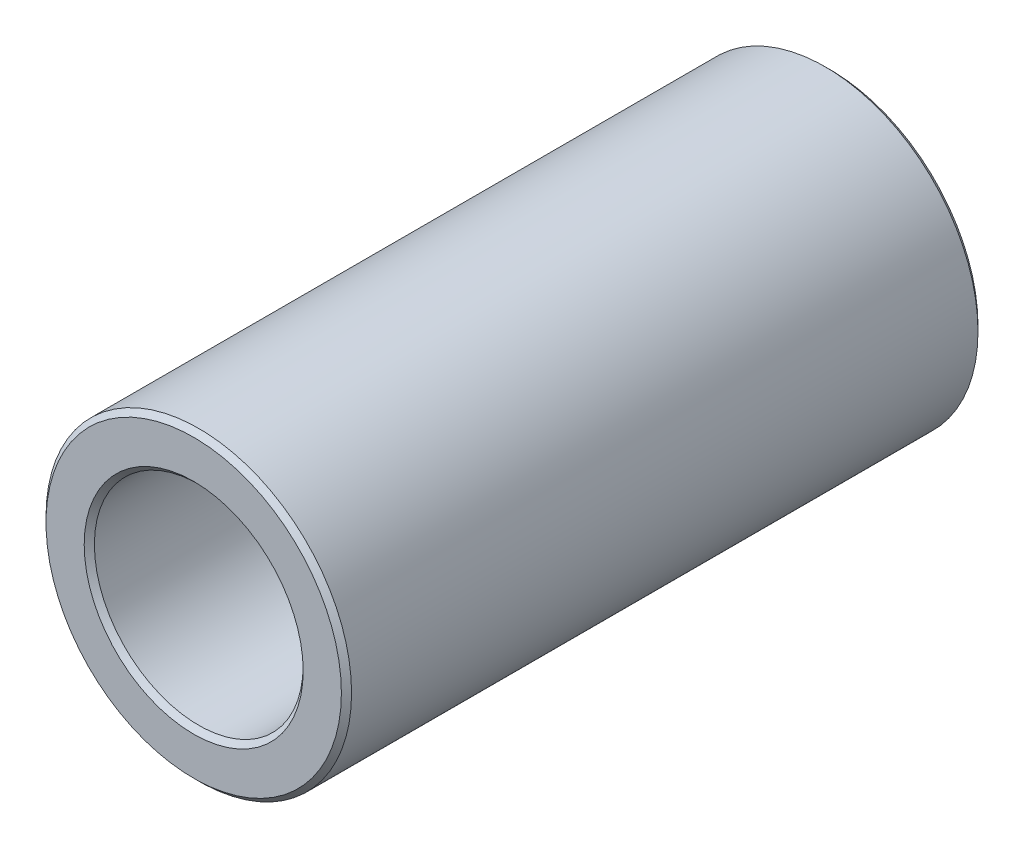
from build123d import *

# Parameters (mm, degrees)
SKETCH1_R           = 6
SKETCH1_R_2         = 4.1
BOSS_EXTRUDE2_DEPTH = 12.5
CHAMFER3_SIZE       = 0.2


with BuildPart() as part:
    # Sketch1 → Boss-Extrude2 (new, symmetric)
    with BuildSketch(Plane.XY):
        Circle(SKETCH1_R)
        Circle(SKETCH1_R_2, mode=Mode.SUBTRACT)
    extrude(amount=BOSS_EXTRUDE2_DEPTH, both=True)

    # Chamfer3
    chamfer3_edges = [part.edges().sort_by_distance(p)[0] for p in [
        (-6, 0, -12.5),
        (-6, 0, 12.5),
        (-4.1, 0, -12.5),
        (-4.1, 0, 12.5),
    ]]
    chamfer(chamfer3_edges, length=CHAMFER3_SIZE)


solid = part.part
